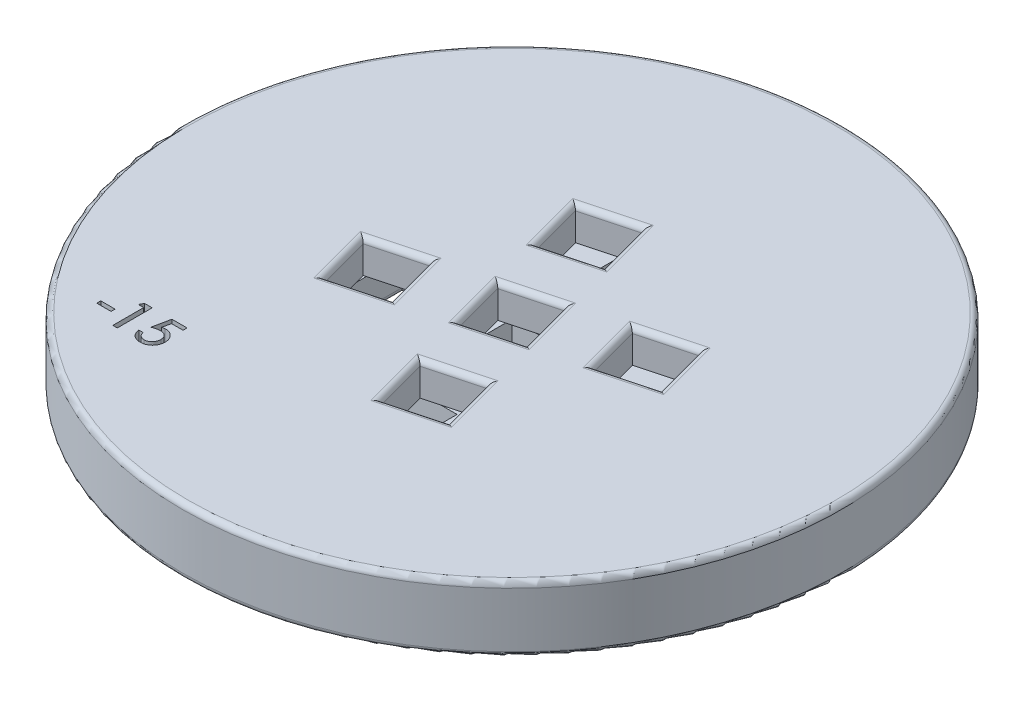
from build123d import *

# Parameters (mm, degrees)
SKETCH1_R           = 30
BOSS_EXTRUDE1_DEPTH = 6
SKETCH4_W           = 5
SKETCH4_H           = 5
CUT_EXTRUDE2_DEPTH  = 3
FILLET2_R           = 0.5
FILLET3_R           = 0.5
SKETCH6_W           = 1.302564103
SKETCH6_H           = 0.366346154
CUT_EXTRUDE3_DEPTH  = 3
FILLET5_R           = 0.5


with BuildPart() as part:
    # Sketch1 → Boss-Extrude1 (new body)
    with BuildSketch(Plane(origin=(0, 0, 0), x_dir=(1, 0, 0), z_dir=(0, 1, 0))):
        with Locations(Location((0, 0, 0), (0, 0, 270))):
            Circle(SKETCH1_R)
    extrude(amount=BOSS_EXTRUDE1_DEPTH)

    # Sketch4 → Cut-Extrude2 (cut)
    with BuildSketch(Plane(origin=(0, 0, 0), x_dir=(-1, 0, 0), z_dir=(0, -1, 0))):
        Rectangle(SKETCH4_W, SKETCH4_H)
        with Locations((0, -10)):
            Rectangle(SKETCH4_W, SKETCH4_H)
        with Locations((10, 0)):
            Rectangle(SKETCH4_W, SKETCH4_H)
        with Locations((-10, 0)):
            Rectangle(SKETCH4_W, SKETCH4_H)
        with Locations((0, 10)):
            Rectangle(SKETCH4_W, SKETCH4_H)
    extrude(amount=-CUT_EXTRUDE2_DEPTH, mode=Mode.SUBTRACT)

    # Fillet2
    fillet2_edges = [part.edges().sort_by_distance(p)[0] for p in [
        (0, 0, -30),
        (-2.5, 0, 10),
        (0, 0, 7.5),
        (2.5, 0, 10),
        (0, 0, 12.5),
        (-12.5, 0, 0),
        (-10, 0, -2.5),
        (-7.5, 0, 0),
        (-10, 0, 2.5),
        (7.5, 0, 0),
        (10, 0, -2.5),
        (12.5, 0, 0),
        (10, 0, 2.5),
        (2.5, 0, -10),
        (0, 0, -7.5),
        (-2.5, 0, -10),
        (0, 0, -12.5),
        (-2.5, 0, 0),
        (0, 0, -2.5),
        (2.5, 0, 0),
        (0, 0, 2.5),
    ]]
    fillet(fillet2_edges, radius=FILLET2_R)

    # Fillet3
    fillet3_edges = [part.edges().sort_by_distance(p)[0] for p in [
        (0, 6, -30),
    ]]
    fillet(fillet3_edges, radius=FILLET3_R)

    # Sketch6 → Cut-Extrude3 (cut)
    with BuildSketch(Plane(origin=(0, 6, 0), x_dir=(1, 0, 0), z_dir=(0, 1, 0))):
        Polygon((-1.767766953, -3.061862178), (3.061862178, -1.767766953), (1.767766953, 3.061862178), (-3.061862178, 1.767766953), align=None)
        Polygon((-4.355957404, 6.597396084), (0.473671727, 7.89149131), (-0.820423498, 12.721120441), (-5.65005263, 11.427025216), align=None)
        Polygon((5.65005263, -11.427025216), (0.820423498, -12.721120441), (-0.473671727, -7.89149131), (4.355957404, -6.597396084), align=None)
        Polygon((12.721120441, 0.820423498), (7.89149131, -0.473671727), (6.597396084, 4.355957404), (11.427025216, 5.65005263), align=None)
        Polygon((-11.427025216, -5.65005263), (-6.597396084, -4.355957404), (-7.89149131, 0.473671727), (-12.721120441, -0.820423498), align=None)
        with Locations((-19.019069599, -17.945677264)):
            Rectangle(SKETCH6_W, SKETCH6_H)
        Polygon((-17.471002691, -15.971478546), (-16.780287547, -15.971478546), (-16.780287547, -19.146478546), (-17.187338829, -19.146478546), (-17.187338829, -16.3378247), (-17.675800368, -16.3378247), align=None)
        with BuildLine():
            Line((-13.605287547, -15.971478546), (-13.605287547, -16.3378247))
            Line((-13.605287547, -16.3378247), (-14.648356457, -16.3378247))
            Line((-14.648356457, -16.3378247), (-14.818809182, -17.090233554))
            add(Edge.make_bspline(
                [(-14.818809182, -17.090233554), (-14.798923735, -17.080650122), (-14.757999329, -17.060927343), (-14.689579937, -17.043742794), (-14.615295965, -17.031651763), (-14.563400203, -17.030441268), (-14.536417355, -17.029811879)],
                knots=[0, 0, 0, 0, 0.906577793, 1.865744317, 2.890308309, 4, 4, 4, 4], degree=3))
            add(Edge.make_bspline(
                [(-14.536417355, -17.029811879), (-14.498201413, -17.030511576), (-14.423170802, -17.031885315), (-14.313819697, -17.047236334), (-14.209618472, -17.070234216), (-14.111424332, -17.104542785), (-14.018115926, -17.14677826), (-13.930705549, -17.19962982), (-13.849283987, -17.262200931), (-13.773960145, -17.333426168), (-13.705309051, -17.411007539), (-13.646347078, -17.494787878), (-13.595237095, -17.582319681), (-13.554724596, -17.675115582), (-13.522715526, -17.772215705), (-13.499951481, -17.874025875), (-13.485479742, -17.980241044), (-13.483948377, -18.052692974), (-13.483172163, -18.089417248)],
                knots=[0, 0, 0, 0, 1.094894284, 2.149641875, 3.159658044, 4.149576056, 5.125966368, 6.091225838, 7.071072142, 8.064343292, 9.05924964, 10.03573454, 10.996966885, 11.96032995, 12.932910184, 13.923798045, 14.947619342, 16, 16, 16, 16], degree=3))
            add(Edge.make_bspline(
                [(-13.483172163, -18.089417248), (-13.483769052, -18.11507932), (-13.4849498, -18.165843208), (-13.491102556, -18.241325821), (-13.502847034, -18.315180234), (-13.518440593, -18.387976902), (-13.53992729, -18.45909175), (-13.564387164, -18.529470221), (-13.594438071, -18.597990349), (-13.628746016, -18.664623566), (-13.666810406, -18.728882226), (-13.708721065, -18.78998682), (-13.754573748, -18.847448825), (-13.804531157, -18.900787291), (-13.857227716, -18.951374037), (-13.914038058, -18.997888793), (-13.974800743, -19.040526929), (-14.038649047, -19.079754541), (-14.105552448, -19.115193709), (-14.175904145, -19.144536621), (-14.247957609, -19.171197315), (-14.32349488, -19.191160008), (-14.401091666, -19.207957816), (-14.481679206, -19.219105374), (-14.564692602, -19.226373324), (-14.620991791, -19.227377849), (-14.649628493, -19.227888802)],
                knots=[0, 0, 0, 0, 1.012275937, 2.002451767, 2.98397589, 3.959820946, 4.936095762, 5.911940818, 6.896771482, 7.884012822, 8.866284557, 9.840372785, 10.804070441, 11.762530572, 12.720625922, 13.68308951, 14.655094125, 15.646011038, 16.637104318, 17.63729087, 18.650257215, 19.66446511, 20.715636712, 21.77986274, 22.870722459, 24, 24, 24, 24], degree=3))
            add(Edge.make_bspline(
                [(-14.649628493, -19.227888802), (-14.681881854, -19.22711447), (-14.745511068, -19.225586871), (-14.838963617, -19.21475197), (-14.928616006, -19.196368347), (-15.014088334, -19.170052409), (-15.09601652, -19.137044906), (-15.173702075, -19.096212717), (-15.247446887, -19.047922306), (-15.31734592, -18.99309428), (-15.381096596, -18.930550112), (-15.439860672, -18.863219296), (-15.489928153, -18.788622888), (-15.533972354, -18.708819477), (-15.571816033, -18.623159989), (-15.601922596, -18.531482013), (-15.625996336, -18.434132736), (-15.635618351, -18.366829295), (-15.640543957, -18.332375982)],
                knots=[0, 0, 0, 0, 1.049569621, 2.070583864, 3.057046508, 4.023914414, 4.977170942, 5.927726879, 6.875021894, 7.842677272, 8.813672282, 9.777581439, 10.74592533, 11.731059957, 12.74126976, 13.788569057, 14.867946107, 16, 16, 16, 16], degree=3))
            Line((-15.640543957, -18.332375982), (-15.24303294, -18.332375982))
            add(Edge.make_bspline(
                [(-15.24303294, -18.332375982), (-15.235467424, -18.365649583), (-15.221265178, -18.428111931), (-15.19075465, -18.513221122), (-15.158054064, -18.585607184), (-15.118058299, -18.644806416), (-15.072153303, -18.693399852), (-15.021202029, -18.73558035), (-14.965225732, -18.773417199), (-14.903601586, -18.804825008), (-14.838673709, -18.830270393), (-14.771211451, -18.848029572), (-14.702577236, -18.859196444), (-14.656242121, -18.860760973), (-14.633092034, -18.861542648)],
                knots=[0, 0, 0, 0, 1.385459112, 2.600831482, 3.66841355, 4.605180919, 5.48910649, 6.376050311, 7.288896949, 8.229144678, 9.181161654, 10.117453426, 11.059436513, 12, 12, 12, 12], degree=3))
            add(Edge.make_bspline(
                [(-14.633092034, -18.861542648), (-14.608048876, -18.860701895), (-14.558605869, -18.859041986), (-14.485768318, -18.849104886), (-14.416108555, -18.830723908), (-14.348620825, -18.806898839), (-14.284483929, -18.774448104), (-14.222123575, -18.736557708), (-14.163813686, -18.690029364), (-14.10792458, -18.638295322), (-14.056735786, -18.580991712), (-14.01216304, -18.519077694), (-13.974140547, -18.453796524), (-13.943839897, -18.384713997), (-13.919248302, -18.312463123), (-13.902345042, -18.236550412), (-13.89179914, -18.157134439), (-13.890755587, -18.103019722), (-13.890223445, -18.07542486)],
                knots=[0, 0, 0, 0, 0.99750234, 1.969380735, 2.919490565, 3.862219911, 4.813679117, 5.776605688, 6.762898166, 7.778387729, 8.806918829, 9.816812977, 10.811632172, 11.809420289, 12.815921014, 13.846113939, 14.901663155, 16, 16, 16, 16], degree=3))
            add(Edge.make_bspline(
                [(-13.890223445, -18.07542486), (-13.890856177, -18.050803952), (-13.892098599, -18.002458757), (-13.901199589, -17.931800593), (-13.915635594, -17.864401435), (-13.936612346, -17.800894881), (-13.963577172, -17.740929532), (-13.996735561, -17.684888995), (-14.035986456, -17.632461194), (-14.080127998, -17.583476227), (-14.130097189, -17.539707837), (-14.183749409, -17.500535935), (-14.242713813, -17.468854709), (-14.304863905, -17.441743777), (-14.371637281, -17.421930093), (-14.441837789, -17.405964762), (-14.516744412, -17.398294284), (-14.567994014, -17.396882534), (-14.594294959, -17.396158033)],
                knots=[0, 0, 0, 0, 1.071512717, 2.104004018, 3.095982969, 4.067795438, 5.009520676, 5.952827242, 6.895998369, 7.856350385, 8.817411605, 9.782937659, 10.74115891, 11.725120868, 12.729302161, 13.768330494, 14.854722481, 16, 16, 16, 16], degree=3))
            add(Edge.make_bspline(
                [(-14.594294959, -17.396158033), (-14.616785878, -17.396697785), (-14.664003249, -17.397830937), (-14.737890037, -17.406024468), (-14.818293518, -17.418911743), (-14.905086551, -17.436735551), (-14.998352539, -17.459956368), (-15.098204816, -17.488094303), (-15.204753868, -17.520927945), (-15.277449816, -17.546040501), (-15.314902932, -17.558978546)],
                knots=[0, 0, 0, 0, 0.727614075, 1.527550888, 2.402655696, 3.361819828, 4.39328773, 5.511706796, 6.718025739, 8, 8, 8, 8], degree=3))
            Line((-15.314902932, -17.558978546), (-14.981629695, -15.971478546))
            Line((-14.981629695, -15.971478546), (-13.605287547, -15.971478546))
        make_face()
    extrude(amount=-CUT_EXTRUDE3_DEPTH, mode=Mode.SUBTRACT)

    # Fillet5
    fillet5_edges = [part.edges().sort_by_distance(p)[0] for p in [
        (-2.414814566, 6, 0.647047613),
        (0.647047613, 6, 2.414814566),
        (2.414814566, 6, -0.647047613),
        (-0.647047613, 6, -2.414814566),
        (-5.003005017, 6, -9.01221065),
        (-1.941142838, 6, -7.244443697),
        (-0.173375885, 6, -10.306305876),
        (-3.235238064, 6, -12.074072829),
        (5.003005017, 6, 9.01221065),
        (1.941142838, 6, 7.244443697),
        (0.173375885, 6, 10.306305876),
        (3.235238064, 6, 12.074072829),
        (12.074072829, 6, -3.235238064),
        (9.01221065, 6, -5.003005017),
        (7.244443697, 6, -1.941142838),
        (10.306305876, 6, -0.173375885),
        (-12.074072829, 6, 3.235238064),
        (-9.01221065, 6, 5.003005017),
        (-7.244443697, 6, 1.941142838),
        (-10.306305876, 6, 0.173375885),
    ]]
    fillet(fillet5_edges, radius=FILLET5_R)


solid = part.part
